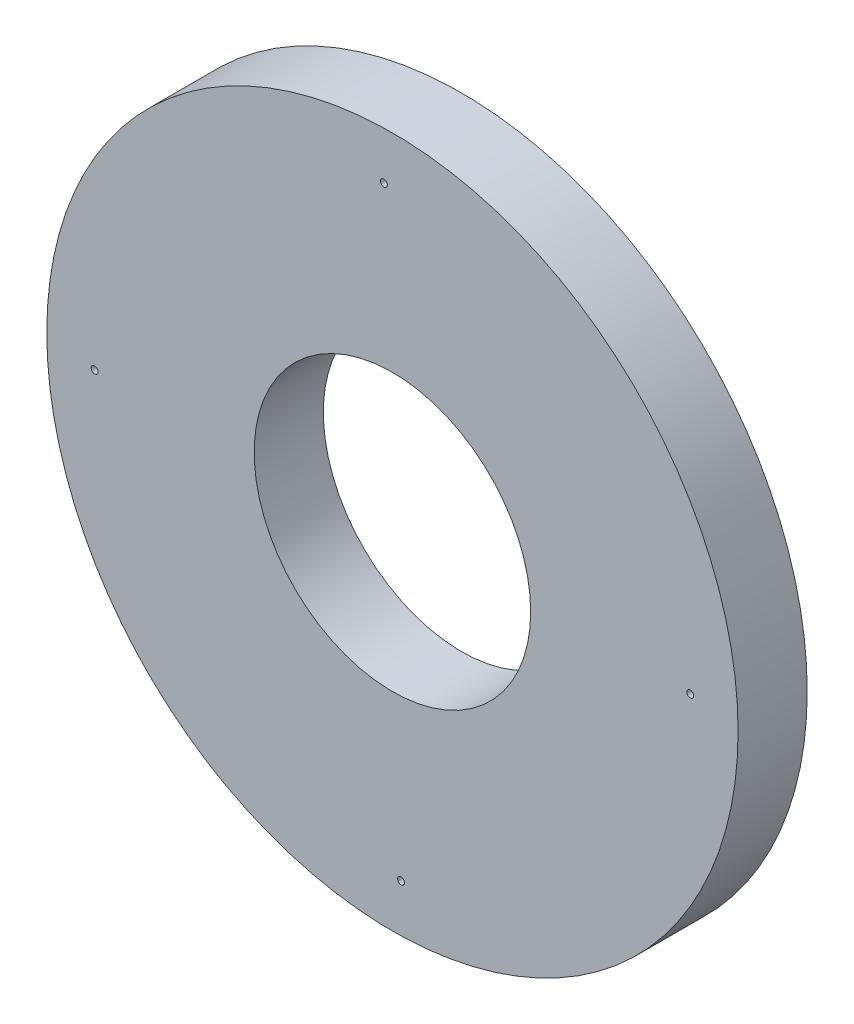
from build123d import *

# Parameters (mm, degrees)
SKETCH1_R           = 31.75
SKETCH1_R_2         = 12.7
SKETCH1_R_3         = 0.3175
BOSS_EXTRUDE1_DEPTH = 6.35


with BuildPart() as part:
    # Sketch1 → Boss-Extrude1 (new body)
    with BuildSketch(Plane.XY):
        with Locations((-8.368081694, 3.175)):
            Circle(SKETCH1_R)
        with Locations((-8.368081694, 3.175)):
            Circle(SKETCH1_R_2, mode=Mode.SUBTRACT)
        with Locations((-35.725213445, 2.38624491)):
            Circle(SKETCH1_R_3, mode=Mode.SUBTRACT)
        with Locations((-7.579326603, -24.182131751)):
            Circle(SKETCH1_R_3, mode=Mode.SUBTRACT)
        with Locations((-9.156836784, 30.532131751)):
            Circle(SKETCH1_R_3, mode=Mode.SUBTRACT)
        with Locations((18.989050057, 3.96375509)):
            Circle(SKETCH1_R_3, mode=Mode.SUBTRACT)
    extrude(amount=BOSS_EXTRUDE1_DEPTH)


solid = part.part
